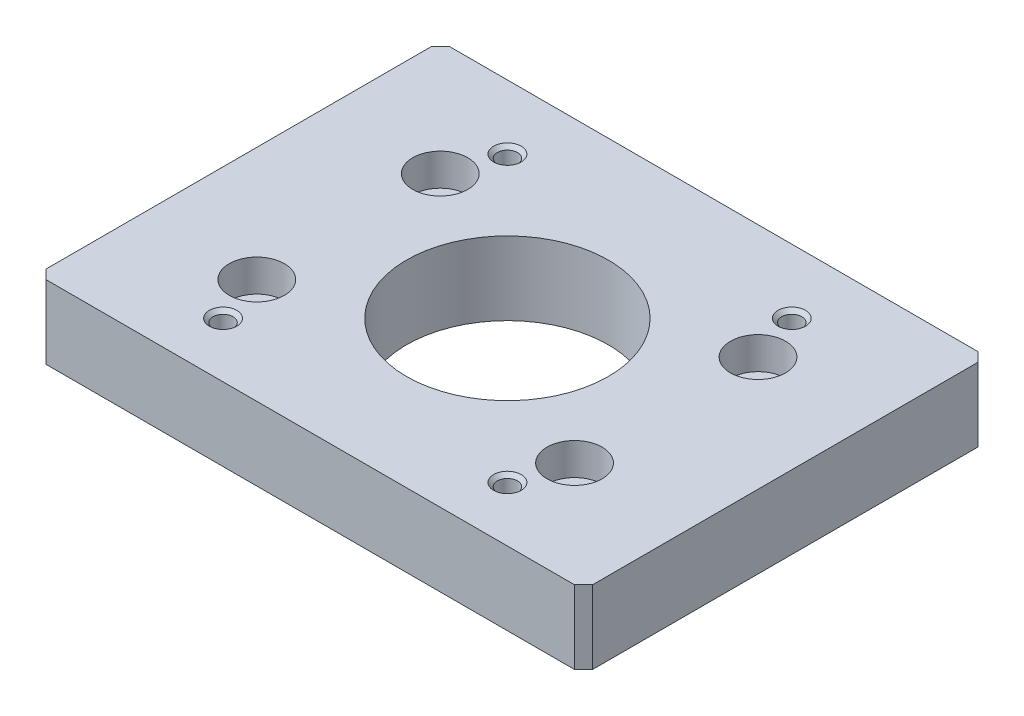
ISO-10303-21;
HEADER;
FILE_DESCRIPTION(('STEP AP214'),'2;1');
FILE_NAME('part.step','',(''),(''),'','','');
FILE_SCHEMA(('AUTOMOTIVE_DESIGN { 1 0 10303 214 1 1 1 1 }'));
ENDSEC;
DATA;
#1=APPLICATION_CONTEXT('core data for automotive mechanical design processes');
#2=APPLICATION_PROTOCOL_DEFINITION('international standard','automotive_design',2000,#1);
#3=PRODUCT_CONTEXT('',#1,'mechanical');
#4=PRODUCT('Part','Part','',(#3));
#5=PRODUCT_RELATED_PRODUCT_CATEGORY('part','',(#4));
#6=PRODUCT_DEFINITION_FORMATION('','',#4);
#7=PRODUCT_DEFINITION_CONTEXT('part definition',#1,'design');
#8=PRODUCT_DEFINITION('design','',#6,#7);
#9=PRODUCT_DEFINITION_SHAPE('','',#8);
#10=(LENGTH_UNIT() NAMED_UNIT(*) SI_UNIT(.MILLI.,.METRE.));
#11=(NAMED_UNIT(*) PLANE_ANGLE_UNIT() SI_UNIT($,.RADIAN.));
#12=(NAMED_UNIT(*) SI_UNIT($,.STERADIAN.) SOLID_ANGLE_UNIT());
#13=UNCERTAINTY_MEASURE_WITH_UNIT(LENGTH_MEASURE(1.E-05),#10,'distance_accuracy_value','');
#14=(GEOMETRIC_REPRESENTATION_CONTEXT(3) GLOBAL_UNCERTAINTY_ASSIGNED_CONTEXT((#13)) GLOBAL_UNIT_ASSIGNED_CONTEXT((#10,
#11,#12)) REPRESENTATION_CONTEXT('',''));
#15=CARTESIAN_POINT('',(0.,0.,0.));
#16=DIRECTION('',(0.,0.,1.));
#17=DIRECTION('',(1.,0.,0.));
#18=AXIS2_PLACEMENT_3D('',#15,#16,#17);
#19=CARTESIAN_POINT('',(-15.5,7.60000000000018,-15.));
#20=DIRECTION('',(0.,1.,0.));
#21=DIRECTION('',(-1.,0.,0.));
#22=AXIS2_PLACEMENT_3D('',#19,#20,#21);
#23=CONICAL_SURFACE('',#22,1.09999999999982,0.785398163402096);
#24=CARTESIAN_POINT('',(-15.5,7.6,-15.));
#25=DIRECTION('',(0.,1.,0.));
#26=DIRECTION('',(1.,0.,0.));
#27=AXIS2_PLACEMENT_3D('',#24,#25,#26);
#28=CIRCLE('',#27,1.1);
#29=CARTESIAN_POINT('',(-14.4,7.6,-15.));
#30=VERTEX_POINT('',#29);
#31=EDGE_CURVE('E191',#30,#30,#28,.F.);
#32=ORIENTED_EDGE('',*,*,#31,.T.);
#33=EDGE_LOOP('',(#32));
#34=FACE_BOUND('',#33,.T.);
#35=CARTESIAN_POINT('',(-15.5,7.99999999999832,-15.));
#36=DIRECTION('',(0.,1.,0.));
#37=DIRECTION('',(-1.,0.,0.));
#38=AXIS2_PLACEMENT_3D('',#35,#36,#37);
#39=CIRCLE('',#38,1.50000000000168);
#40=CARTESIAN_POINT('',(-17.0000000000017,7.99999999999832,-15.));
#41=VERTEX_POINT('',#40);
#42=EDGE_CURVE('E174',#41,#41,#39,.T.);
#43=ORIENTED_EDGE('',*,*,#42,.T.);
#44=EDGE_LOOP('',(#43));
#45=FACE_BOUND('',#44,.T.);
#46=ADVANCED_FACE('F16',(#34,#45),#23,.F.);
#47=CARTESIAN_POINT('',(15.5,7.60000000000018,-15.));
#48=DIRECTION('',(0.,1.,0.));
#49=DIRECTION('',(-1.,0.,0.));
#50=AXIS2_PLACEMENT_3D('',#47,#48,#49);
#51=CONICAL_SURFACE('',#50,1.09999999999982,0.785398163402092);
#52=CARTESIAN_POINT('',(15.5,7.6,-15.));
#53=DIRECTION('',(0.,1.,0.));
#54=DIRECTION('',(1.,0.,0.));
#55=AXIS2_PLACEMENT_3D('',#52,#53,#54);
#56=CIRCLE('',#55,1.1);
#57=CARTESIAN_POINT('',(16.6,7.6,-15.));
#58=VERTEX_POINT('',#57);
#59=EDGE_CURVE('E195',#58,#58,#56,.F.);
#60=ORIENTED_EDGE('',*,*,#59,.T.);
#61=EDGE_LOOP('',(#60));
#62=FACE_BOUND('',#61,.T.);
#63=CARTESIAN_POINT('',(15.5,7.99999999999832,-15.));
#64=DIRECTION('',(0.,1.,0.));
#65=DIRECTION('',(-1.,0.,0.));
#66=AXIS2_PLACEMENT_3D('',#63,#64,#65);
#67=CIRCLE('',#66,1.50000000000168);
#68=CARTESIAN_POINT('',(13.9999999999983,7.99999999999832,-15.));
#69=VERTEX_POINT('',#68);
#70=EDGE_CURVE('E171',#69,#69,#67,.T.);
#71=ORIENTED_EDGE('',*,*,#70,.T.);
#72=EDGE_LOOP('',(#71));
#73=FACE_BOUND('',#72,.T.);
#74=ADVANCED_FACE('F359',(#62,#73),#51,.F.);
#75=CARTESIAN_POINT('',(-15.5,7.60000000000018,16.));
#76=DIRECTION('',(0.,1.,0.));
#77=DIRECTION('',(0.,0.,1.));
#78=AXIS2_PLACEMENT_3D('',#75,#76,#77);
#79=CONICAL_SURFACE('',#78,1.09999999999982,0.785398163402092);
#80=CARTESIAN_POINT('',(-15.5,7.6,16.));
#81=DIRECTION('',(0.,1.,0.));
#82=DIRECTION('',(1.,0.,0.));
#83=AXIS2_PLACEMENT_3D('',#80,#81,#82);
#84=CIRCLE('',#83,1.1);
#85=CARTESIAN_POINT('',(-14.4,7.6,16.));
#86=VERTEX_POINT('',#85);
#87=EDGE_CURVE('E208',#86,#86,#84,.F.);
#88=ORIENTED_EDGE('',*,*,#87,.T.);
#89=EDGE_LOOP('',(#88));
#90=FACE_BOUND('',#89,.T.);
#91=CARTESIAN_POINT('',(-15.5,7.99999999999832,16.));
#92=DIRECTION('',(0.,1.,0.));
#93=DIRECTION('',(0.,0.,1.));
#94=AXIS2_PLACEMENT_3D('',#91,#92,#93);
#95=CIRCLE('',#94,1.50000000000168);
#96=CARTESIAN_POINT('',(-15.5,7.99999999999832,17.5000000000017));
#97=VERTEX_POINT('',#96);
#98=EDGE_CURVE('E168',#97,#97,#95,.T.);
#99=ORIENTED_EDGE('',*,*,#98,.T.);
#100=EDGE_LOOP('',(#99));
#101=FACE_BOUND('',#100,.T.);
#102=ADVANCED_FACE('F355',(#90,#101),#79,.F.);
#103=CARTESIAN_POINT('',(15.5,7.60000000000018,16.));
#104=DIRECTION('',(0.,1.,0.));
#105=DIRECTION('',(0.,0.,1.));
#106=AXIS2_PLACEMENT_3D('',#103,#104,#105);
#107=CONICAL_SURFACE('',#106,1.09999999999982,0.785398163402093);
#108=CARTESIAN_POINT('',(15.5,7.6,16.));
#109=DIRECTION('',(0.,1.,0.));
#110=DIRECTION('',(1.,0.,0.));
#111=AXIS2_PLACEMENT_3D('',#108,#109,#110);
#112=CIRCLE('',#111,1.1);
#113=CARTESIAN_POINT('',(16.6,7.6,16.));
#114=VERTEX_POINT('',#113);
#115=EDGE_CURVE('E200',#114,#114,#112,.F.);
#116=ORIENTED_EDGE('',*,*,#115,.T.);
#117=EDGE_LOOP('',(#116));
#118=FACE_BOUND('',#117,.T.);
#119=CARTESIAN_POINT('',(15.5,7.99999999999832,16.));
#120=DIRECTION('',(0.,1.,0.));
#121=DIRECTION('',(0.,0.,1.));
#122=AXIS2_PLACEMENT_3D('',#119,#120,#121);
#123=CIRCLE('',#122,1.50000000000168);
#124=CARTESIAN_POINT('',(15.5,7.99999999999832,17.5000000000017));
#125=VERTEX_POINT('',#124);
#126=EDGE_CURVE('E165',#125,#125,#123,.T.);
#127=ORIENTED_EDGE('',*,*,#126,.T.);
#128=EDGE_LOOP('',(#127));
#129=FACE_BOUND('',#128,.T.);
#130=ADVANCED_FACE('F352',(#118,#129),#107,.F.);
#131=CARTESIAN_POINT('',(17.32050807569,4.5,-9.5));
#132=DIRECTION('',(0.,1.,0.));
#133=DIRECTION('',(0.,0.,1.));
#134=AXIS2_PLACEMENT_3D('',#131,#132,#133);
#135=CYLINDRICAL_SURFACE('',#134,3.);
#136=CARTESIAN_POINT('',(17.32050807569,4.5,-9.5));
#137=DIRECTION('',(0.,1.,0.));
#138=DIRECTION('',(0.,0.,1.));
#139=AXIS2_PLACEMENT_3D('',#136,#137,#138);
#140=CIRCLE('',#139,3.);
#141=CARTESIAN_POINT('',(17.32050807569,4.5,-6.5));
#142=VERTEX_POINT('',#141);
#143=EDGE_CURVE('E20',#142,#142,#140,.F.);
#144=ORIENTED_EDGE('',*,*,#143,.T.);
#145=EDGE_LOOP('',(#144));
#146=FACE_BOUND('',#145,.T.);
#147=CARTESIAN_POINT('',(17.32050807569,8.,-9.5));
#148=DIRECTION('',(0.,1.,0.));
#149=DIRECTION('',(0.,0.,1.));
#150=AXIS2_PLACEMENT_3D('',#147,#148,#149);
#151=CIRCLE('',#150,3.);
#152=CARTESIAN_POINT('',(17.32050807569,8.,-6.5));
#153=VERTEX_POINT('',#152);
#154=EDGE_CURVE('E162',#153,#153,#151,.T.);
#155=ORIENTED_EDGE('',*,*,#154,.T.);
#156=EDGE_LOOP('',(#155));
#157=FACE_BOUND('',#156,.T.);
#158=ADVANCED_FACE('F348',(#146,#157),#135,.F.);
#159=CARTESIAN_POINT('',(-17.32050807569,4.5,-9.5));
#160=DIRECTION('',(0.,1.,0.));
#161=DIRECTION('',(0.,0.,1.));
#162=AXIS2_PLACEMENT_3D('',#159,#160,#161);
#163=CYLINDRICAL_SURFACE('',#162,3.);
#164=CARTESIAN_POINT('',(-17.32050807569,4.5,-9.5));
#165=DIRECTION('',(0.,1.,0.));
#166=DIRECTION('',(0.,0.,1.));
#167=AXIS2_PLACEMENT_3D('',#164,#165,#166);
#168=CIRCLE('',#167,3.);
#169=CARTESIAN_POINT('',(-17.32050807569,4.5,-6.5));
#170=VERTEX_POINT('',#169);
#171=EDGE_CURVE('E184',#170,#170,#168,.F.);
#172=ORIENTED_EDGE('',*,*,#171,.T.);
#173=EDGE_LOOP('',(#172));
#174=FACE_BOUND('',#173,.T.);
#175=CARTESIAN_POINT('',(-17.32050807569,8.,-9.5));
#176=DIRECTION('',(0.,1.,0.));
#177=DIRECTION('',(0.,0.,1.));
#178=AXIS2_PLACEMENT_3D('',#175,#176,#177);
#179=CIRCLE('',#178,3.);
#180=CARTESIAN_POINT('',(-17.32050807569,8.,-6.5));
#181=VERTEX_POINT('',#180);
#182=EDGE_CURVE('E159',#181,#181,#179,.T.);
#183=ORIENTED_EDGE('',*,*,#182,.T.);
#184=EDGE_LOOP('',(#183));
#185=FACE_BOUND('',#184,.T.);
#186=ADVANCED_FACE('F344',(#174,#185),#163,.F.);
#187=CARTESIAN_POINT('',(-17.32050807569,4.5,10.5));
#188=DIRECTION('',(0.,1.,0.));
#189=DIRECTION('',(0.,0.,1.));
#190=AXIS2_PLACEMENT_3D('',#187,#188,#189);
#191=CYLINDRICAL_SURFACE('',#190,3.);
#192=CARTESIAN_POINT('',(-17.32050807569,4.5,10.5));
#193=DIRECTION('',(0.,1.,0.));
#194=DIRECTION('',(0.,0.,1.));
#195=AXIS2_PLACEMENT_3D('',#192,#193,#194);
#196=CIRCLE('',#195,3.);
#197=CARTESIAN_POINT('',(-17.32050807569,4.5,13.5));
#198=VERTEX_POINT('',#197);
#199=EDGE_CURVE('E90',#198,#198,#196,.F.);
#200=ORIENTED_EDGE('',*,*,#199,.T.);
#201=EDGE_LOOP('',(#200));
#202=FACE_BOUND('',#201,.T.);
#203=CARTESIAN_POINT('',(-17.32050807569,8.,10.5));
#204=DIRECTION('',(0.,1.,0.));
#205=DIRECTION('',(0.,0.,1.));
#206=AXIS2_PLACEMENT_3D('',#203,#204,#205);
#207=CIRCLE('',#206,3.);
#208=CARTESIAN_POINT('',(-17.32050807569,8.,13.5));
#209=VERTEX_POINT('',#208);
#210=EDGE_CURVE('E107',#209,#209,#207,.T.);
#211=ORIENTED_EDGE('',*,*,#210,.T.);
#212=EDGE_LOOP('',(#211));
#213=FACE_BOUND('',#212,.T.);
#214=ADVANCED_FACE('F341',(#202,#213),#191,.F.);
#215=CARTESIAN_POINT('',(17.32050807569,4.5,10.5));
#216=DIRECTION('',(0.,1.,0.));
#217=DIRECTION('',(0.,0.,1.));
#218=AXIS2_PLACEMENT_3D('',#215,#216,#217);
#219=CYLINDRICAL_SURFACE('',#218,3.);
#220=CARTESIAN_POINT('',(17.32050807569,4.5,10.5));
#221=DIRECTION('',(0.,1.,0.));
#222=DIRECTION('',(0.,0.,1.));
#223=AXIS2_PLACEMENT_3D('',#220,#221,#222);
#224=CIRCLE('',#223,3.);
#225=CARTESIAN_POINT('',(17.32050807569,4.5,13.5));
#226=VERTEX_POINT('',#225);
#227=EDGE_CURVE('E186',#226,#226,#224,.F.);
#228=ORIENTED_EDGE('',*,*,#227,.T.);
#229=EDGE_LOOP('',(#228));
#230=FACE_BOUND('',#229,.T.);
#231=CARTESIAN_POINT('',(17.32050807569,8.,10.5));
#232=DIRECTION('',(0.,1.,0.));
#233=DIRECTION('',(0.,0.,1.));
#234=AXIS2_PLACEMENT_3D('',#231,#232,#233);
#235=CIRCLE('',#234,3.);
#236=CARTESIAN_POINT('',(17.32050807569,8.,13.5));
#237=VERTEX_POINT('',#236);
#238=EDGE_CURVE('E104',#237,#237,#235,.T.);
#239=ORIENTED_EDGE('',*,*,#238,.T.);
#240=EDGE_LOOP('',(#239));
#241=FACE_BOUND('',#240,.T.);
#242=ADVANCED_FACE('F338',(#230,#241),#219,.F.);
#243=CARTESIAN_POINT('',(-29.86914683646,8.16,-20.93085316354));
#244=DIRECTION('',(-0.707106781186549,0.,-0.707106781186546));
#245=DIRECTION('',(0.707106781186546,0.,-0.707106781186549));
#246=AXIS2_PLACEMENT_3D('',#243,#244,#245);
#247=PLANE('',#246);
#248=DIRECTION('',(0.707106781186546,0.,-0.707106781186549));
#249=VECTOR('',#248,1.);
#250=CARTESIAN_POINT('',(-29.86914683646,8.,-20.93085316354));
#251=LINE('',#250,#249);
#252=CARTESIAN_POINT('',(-29.8,8.,-21.));
#253=VERTEX_POINT('',#252);
#254=CARTESIAN_POINT('',(-28.8,8.,-22.));
#255=VERTEX_POINT('',#254);
#256=EDGE_CURVE('E177',#253,#255,#251,.T.);
#257=ORIENTED_EDGE('',*,*,#256,.T.);
#258=DIRECTION('',(0.,1.,0.));
#259=VECTOR('',#258,1.);
#260=CARTESIAN_POINT('',(-28.8,4.,-22.));
#261=LINE('',#260,#259);
#262=CARTESIAN_POINT('',(-28.8,0.,-22.));
#263=VERTEX_POINT('',#262);
#264=EDGE_CURVE('E100',#255,#263,#261,.F.);
#265=ORIENTED_EDGE('',*,*,#264,.T.);
#266=DIRECTION('',(-0.707106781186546,0.,0.707106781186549));
#267=VECTOR('',#266,1.);
#268=CARTESIAN_POINT('',(-29.3,0.,-21.5));
#269=LINE('',#268,#267);
#270=CARTESIAN_POINT('',(-29.8,0.,-21.));
#271=VERTEX_POINT('',#270);
#272=EDGE_CURVE('E203',#271,#263,#269,.F.);
#273=ORIENTED_EDGE('',*,*,#272,.F.);
#274=DIRECTION('',(0.,-1.,0.));
#275=VECTOR('',#274,1.);
#276=CARTESIAN_POINT('',(-29.8,4.,-21.));
#277=LINE('',#276,#275);
#278=EDGE_CURVE('E215',#271,#253,#277,.F.);
#279=ORIENTED_EDGE('',*,*,#278,.T.);
#280=EDGE_LOOP('',(#257,#265,#273,#279));
#281=FACE_BOUND('',#280,.T.);
#282=ADVANCED_FACE('F261',(#281),#247,.T.);
#283=CARTESIAN_POINT('',(-28.73085316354,8.16,22.06914683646));
#284=DIRECTION('',(-0.707106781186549,0.,0.707106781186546));
#285=DIRECTION('',(-0.707106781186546,0.,-0.707106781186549));
#286=AXIS2_PLACEMENT_3D('',#283,#284,#285);
#287=PLANE('',#286);
#288=DIRECTION('',(-0.707106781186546,0.,-0.707106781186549));
#289=VECTOR('',#288,1.);
#290=CARTESIAN_POINT('',(-28.73085316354,8.,22.06914683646));
#291=LINE('',#290,#289);
#292=CARTESIAN_POINT('',(-28.8,8.,22.));
#293=VERTEX_POINT('',#292);
#294=CARTESIAN_POINT('',(-29.8,8.,21.));
#295=VERTEX_POINT('',#294);
#296=EDGE_CURVE('E179',#293,#295,#291,.T.);
#297=ORIENTED_EDGE('',*,*,#296,.T.);
#298=DIRECTION('',(0.,1.,0.));
#299=VECTOR('',#298,1.);
#300=CARTESIAN_POINT('',(-29.8,4.,21.));
#301=LINE('',#300,#299);
#302=CARTESIAN_POINT('',(-29.8,0.,21.));
#303=VERTEX_POINT('',#302);
#304=EDGE_CURVE('E214',#295,#303,#301,.F.);
#305=ORIENTED_EDGE('',*,*,#304,.T.);
#306=DIRECTION('',(0.707106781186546,0.,0.707106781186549));
#307=VECTOR('',#306,1.);
#308=CARTESIAN_POINT('',(-29.3,0.,21.5));
#309=LINE('',#308,#307);
#310=CARTESIAN_POINT('',(-28.8,0.,22.));
#311=VERTEX_POINT('',#310);
#312=EDGE_CURVE('E257',#311,#303,#309,.F.);
#313=ORIENTED_EDGE('',*,*,#312,.F.);
#314=DIRECTION('',(0.,-1.,0.));
#315=VECTOR('',#314,1.);
#316=CARTESIAN_POINT('',(-28.8,4.,22.));
#317=LINE('',#316,#315);
#318=EDGE_CURVE('E222',#311,#293,#317,.F.);
#319=ORIENTED_EDGE('',*,*,#318,.T.);
#320=EDGE_LOOP('',(#297,#305,#313,#319));
#321=FACE_BOUND('',#320,.T.);
#322=ADVANCED_FACE('F267',(#321),#287,.T.);
#323=CARTESIAN_POINT('',(28.73085316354,8.16,-22.06914683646));
#324=DIRECTION('',(0.707106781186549,0.,-0.707106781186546));
#325=DIRECTION('',(0.707106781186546,0.,0.707106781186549));
#326=AXIS2_PLACEMENT_3D('',#323,#324,#325);
#327=PLANE('',#326);
#328=DIRECTION('',(0.707106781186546,0.,0.707106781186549));
#329=VECTOR('',#328,1.);
#330=CARTESIAN_POINT('',(28.73085316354,8.,-22.06914683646));
#331=LINE('',#330,#329);
#332=CARTESIAN_POINT('',(28.8,8.,-22.));
#333=VERTEX_POINT('',#332);
#334=CARTESIAN_POINT('',(29.8,8.,-21.));
#335=VERTEX_POINT('',#334);
#336=EDGE_CURVE('E80',#333,#335,#331,.T.);
#337=ORIENTED_EDGE('',*,*,#336,.T.);
#338=DIRECTION('',(0.,1.,0.));
#339=VECTOR('',#338,1.);
#340=CARTESIAN_POINT('',(29.8,4.,-21.));
#341=LINE('',#340,#339);
#342=CARTESIAN_POINT('',(29.8,0.,-21.));
#343=VERTEX_POINT('',#342);
#344=EDGE_CURVE('E113',#335,#343,#341,.F.);
#345=ORIENTED_EDGE('',*,*,#344,.T.);
#346=DIRECTION('',(-0.707106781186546,0.,-0.707106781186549));
#347=VECTOR('',#346,1.);
#348=CARTESIAN_POINT('',(29.3,0.,-21.5));
#349=LINE('',#348,#347);
#350=CARTESIAN_POINT('',(28.8,0.,-22.));
#351=VERTEX_POINT('',#350);
#352=EDGE_CURVE('E103',#351,#343,#349,.F.);
#353=ORIENTED_EDGE('',*,*,#352,.F.);
#354=DIRECTION('',(0.,-1.,0.));
#355=VECTOR('',#354,1.);
#356=CARTESIAN_POINT('',(28.8,4.,-22.));
#357=LINE('',#356,#355);
#358=EDGE_CURVE('E97',#351,#333,#357,.F.);
#359=ORIENTED_EDGE('',*,*,#358,.T.);
#360=EDGE_LOOP('',(#337,#345,#353,#359));
#361=FACE_BOUND('',#360,.T.);
#362=ADVANCED_FACE('F102',(#361),#327,.T.);
#363=CARTESIAN_POINT('',(29.86914683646,8.16,20.93085316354));
#364=DIRECTION('',(0.707106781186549,0.,0.707106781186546));
#365=DIRECTION('',(-0.707106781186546,0.,0.707106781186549));
#366=AXIS2_PLACEMENT_3D('',#363,#364,#365);
#367=PLANE('',#366);
#368=DIRECTION('',(-0.707106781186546,0.,0.707106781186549));
#369=VECTOR('',#368,1.);
#370=CARTESIAN_POINT('',(29.86914683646,8.,20.93085316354));
#371=LINE('',#370,#369);
#372=CARTESIAN_POINT('',(29.8,8.,21.));
#373=VERTEX_POINT('',#372);
#374=CARTESIAN_POINT('',(28.8,8.,22.));
#375=VERTEX_POINT('',#374);
#376=EDGE_CURVE('E89',#373,#375,#371,.T.);
#377=ORIENTED_EDGE('',*,*,#376,.T.);
#378=DIRECTION('',(0.,1.,0.));
#379=VECTOR('',#378,1.);
#380=CARTESIAN_POINT('',(28.8,4.,22.));
#381=LINE('',#380,#379);
#382=CARTESIAN_POINT('',(28.8,0.,22.));
#383=VERTEX_POINT('',#382);
#384=EDGE_CURVE('E111',#375,#383,#381,.F.);
#385=ORIENTED_EDGE('',*,*,#384,.T.);
#386=DIRECTION('',(0.707106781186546,0.,-0.707106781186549));
#387=VECTOR('',#386,1.);
#388=CARTESIAN_POINT('',(29.3,0.,21.5));
#389=LINE('',#388,#387);
#390=CARTESIAN_POINT('',(29.8,0.,21.));
#391=VERTEX_POINT('',#390);
#392=EDGE_CURVE('E35',#391,#383,#389,.F.);
#393=ORIENTED_EDGE('',*,*,#392,.F.);
#394=DIRECTION('',(0.,-1.,0.));
#395=VECTOR('',#394,1.);
#396=CARTESIAN_POINT('',(29.8,4.,21.));
#397=LINE('',#396,#395);
#398=EDGE_CURVE('E114',#391,#373,#397,.F.);
#399=ORIENTED_EDGE('',*,*,#398,.T.);
#400=EDGE_LOOP('',(#377,#385,#393,#399));
#401=FACE_BOUND('',#400,.T.);
#402=ADVANCED_FACE('F228',(#401),#367,.T.);
#403=CARTESIAN_POINT('',(-15.5,0.4,16.));
#404=DIRECTION('',(0.,1.,0.));
#405=DIRECTION('',(0.,0.,1.));
#406=AXIS2_PLACEMENT_3D('',#403,#404,#405);
#407=CYLINDRICAL_SURFACE('',#406,1.1);
#408=CARTESIAN_POINT('',(-15.5,0.399999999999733,16.));
#409=DIRECTION('',(0.,-1.,0.));
#410=DIRECTION('',(0.,0.,-1.));
#411=AXIS2_PLACEMENT_3D('',#408,#409,#410);
#412=CIRCLE('',#411,1.09999999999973);
#413=CARTESIAN_POINT('',(-15.5,0.399999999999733,14.9000000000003));
#414=VERTEX_POINT('',#413);
#415=EDGE_CURVE('E227',#414,#414,#412,.T.);
#416=ORIENTED_EDGE('',*,*,#415,.T.);
#417=EDGE_LOOP('',(#416));
#418=FACE_BOUND('',#417,.T.);
#419=ORIENTED_EDGE('',*,*,#87,.F.);
#420=EDGE_LOOP('',(#419));
#421=FACE_BOUND('',#420,.T.);
#422=ADVANCED_FACE('F333',(#418,#421),#407,.F.);
#423=CARTESIAN_POINT('',(15.5,0.4,16.));
#424=DIRECTION('',(0.,1.,0.));
#425=DIRECTION('',(0.,0.,1.));
#426=AXIS2_PLACEMENT_3D('',#423,#424,#425);
#427=CYLINDRICAL_SURFACE('',#426,1.1);
#428=CARTESIAN_POINT('',(15.5,0.399999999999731,16.));
#429=DIRECTION('',(0.,-1.,0.));
#430=DIRECTION('',(0.,0.,-1.));
#431=AXIS2_PLACEMENT_3D('',#428,#429,#430);
#432=CIRCLE('',#431,1.09999999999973);
#433=CARTESIAN_POINT('',(15.5,0.399999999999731,14.9000000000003));
#434=VERTEX_POINT('',#433);
#435=EDGE_CURVE('E251',#434,#434,#432,.T.);
#436=ORIENTED_EDGE('',*,*,#435,.T.);
#437=EDGE_LOOP('',(#436));
#438=FACE_BOUND('',#437,.T.);
#439=ORIENTED_EDGE('',*,*,#115,.F.);
#440=EDGE_LOOP('',(#439));
#441=FACE_BOUND('',#440,.T.);
#442=ADVANCED_FACE('F329',(#438,#441),#427,.F.);
#443=CARTESIAN_POINT('',(15.5,0.4,-15.));
#444=DIRECTION('',(0.,1.,0.));
#445=DIRECTION('',(0.,0.,1.));
#446=AXIS2_PLACEMENT_3D('',#443,#444,#445);
#447=CYLINDRICAL_SURFACE('',#446,1.1);
#448=CARTESIAN_POINT('',(15.5,0.399999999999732,-15.));
#449=DIRECTION('',(0.,-1.,0.));
#450=DIRECTION('',(0.,0.,-1.));
#451=AXIS2_PLACEMENT_3D('',#448,#449,#450);
#452=CIRCLE('',#451,1.09999999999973);
#453=CARTESIAN_POINT('',(15.5,0.399999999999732,-16.0999999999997));
#454=VERTEX_POINT('',#453);
#455=EDGE_CURVE('E248',#454,#454,#452,.T.);
#456=ORIENTED_EDGE('',*,*,#455,.T.);
#457=EDGE_LOOP('',(#456));
#458=FACE_BOUND('',#457,.T.);
#459=ORIENTED_EDGE('',*,*,#59,.F.);
#460=EDGE_LOOP('',(#459));
#461=FACE_BOUND('',#460,.T.);
#462=ADVANCED_FACE('F325',(#458,#461),#447,.F.);
#463=CARTESIAN_POINT('',(-15.5,0.4,-15.));
#464=DIRECTION('',(0.,1.,0.));
#465=DIRECTION('',(0.,0.,1.));
#466=AXIS2_PLACEMENT_3D('',#463,#464,#465);
#467=CYLINDRICAL_SURFACE('',#466,1.1);
#468=CARTESIAN_POINT('',(-15.5,0.399999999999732,-15.));
#469=DIRECTION('',(0.,-1.,0.));
#470=DIRECTION('',(0.,0.,-1.));
#471=AXIS2_PLACEMENT_3D('',#468,#469,#470);
#472=CIRCLE('',#471,1.09999999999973);
#473=CARTESIAN_POINT('',(-15.5,0.399999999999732,-16.0999999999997));
#474=VERTEX_POINT('',#473);
#475=EDGE_CURVE('E155',#474,#474,#472,.T.);
#476=ORIENTED_EDGE('',*,*,#475,.T.);
#477=EDGE_LOOP('',(#476));
#478=FACE_BOUND('',#477,.T.);
#479=ORIENTED_EDGE('',*,*,#31,.F.);
#480=EDGE_LOOP('',(#479));
#481=FACE_BOUND('',#480,.T.);
#482=ADVANCED_FACE('F321',(#478,#481),#467,.F.);
#483=CARTESIAN_POINT('',(-21.13332839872,4.5,14.02650185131));
#484=DIRECTION('',(0.,1.,0.));
#485=DIRECTION('',(1.,0.,0.));
#486=AXIS2_PLACEMENT_3D('',#483,#484,#485);
#487=PLANE('',#486);
#488=CARTESIAN_POINT('',(17.32050807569,4.5,-9.5));
#489=DIRECTION('',(0.,1.,0.));
#490=DIRECTION('',(0.,0.,1.));
#491=AXIS2_PLACEMENT_3D('',#488,#489,#490);
#492=CIRCLE('',#491,1.74999999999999);
#493=CARTESIAN_POINT('',(17.32050807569,4.5,-7.75000000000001));
#494=VERTEX_POINT('',#493);
#495=EDGE_CURVE('E153',#494,#494,#492,.F.);
#496=ORIENTED_EDGE('',*,*,#495,.T.);
#497=EDGE_LOOP('',(#496));
#498=FACE_BOUND('',#497,.T.);
#499=ORIENTED_EDGE('',*,*,#143,.F.);
#500=EDGE_LOOP('',(#499));
#501=FACE_BOUND('',#500,.T.);
#502=ADVANCED_FACE('F324',(#498,#501),#487,.T.);
#503=CARTESIAN_POINT('',(-21.13332839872,4.5,14.02650185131));
#504=DIRECTION('',(0.,1.,0.));
#505=DIRECTION('',(1.,0.,0.));
#506=AXIS2_PLACEMENT_3D('',#503,#504,#505);
#507=PLANE('',#506);
#508=CARTESIAN_POINT('',(17.32050807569,4.5,10.5));
#509=DIRECTION('',(0.,1.,0.));
#510=DIRECTION('',(0.,0.,1.));
#511=AXIS2_PLACEMENT_3D('',#508,#509,#510);
#512=CIRCLE('',#511,1.74999999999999);
#513=CARTESIAN_POINT('',(17.32050807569,4.5,12.25));
#514=VERTEX_POINT('',#513);
#515=EDGE_CURVE('E150',#514,#514,#512,.F.);
#516=ORIENTED_EDGE('',*,*,#515,.T.);
#517=EDGE_LOOP('',(#516));
#518=FACE_BOUND('',#517,.T.);
#519=ORIENTED_EDGE('',*,*,#227,.F.);
#520=EDGE_LOOP('',(#519));
#521=FACE_BOUND('',#520,.T.);
#522=ADVANCED_FACE('F376',(#518,#521),#507,.T.);
#523=CARTESIAN_POINT('',(-21.13332839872,4.5,14.02650185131));
#524=DIRECTION('',(0.,1.,0.));
#525=DIRECTION('',(1.,0.,0.));
#526=AXIS2_PLACEMENT_3D('',#523,#524,#525);
#527=PLANE('',#526);
#528=CARTESIAN_POINT('',(-17.32050807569,4.5,-9.5));
#529=DIRECTION('',(0.,1.,0.));
#530=DIRECTION('',(0.,0.,1.));
#531=AXIS2_PLACEMENT_3D('',#528,#529,#530);
#532=CIRCLE('',#531,1.75);
#533=CARTESIAN_POINT('',(-17.32050807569,4.5,-7.75));
#534=VERTEX_POINT('',#533);
#535=EDGE_CURVE('E147',#534,#534,#532,.F.);
#536=ORIENTED_EDGE('',*,*,#535,.T.);
#537=EDGE_LOOP('',(#536));
#538=FACE_BOUND('',#537,.T.);
#539=ORIENTED_EDGE('',*,*,#171,.F.);
#540=EDGE_LOOP('',(#539));
#541=FACE_BOUND('',#540,.T.);
#542=ADVANCED_FACE('F380',(#538,#541),#527,.T.);
#543=CARTESIAN_POINT('',(-21.13332839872,4.5,14.02650185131));
#544=DIRECTION('',(0.,1.,0.));
#545=DIRECTION('',(1.,0.,0.));
#546=AXIS2_PLACEMENT_3D('',#543,#544,#545);
#547=PLANE('',#546);
#548=CARTESIAN_POINT('',(-17.32050807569,4.5,10.5));
#549=DIRECTION('',(0.,1.,0.));
#550=DIRECTION('',(0.,0.,1.));
#551=AXIS2_PLACEMENT_3D('',#548,#549,#550);
#552=CIRCLE('',#551,1.75);
#553=CARTESIAN_POINT('',(-17.32050807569,4.5,12.25));
#554=VERTEX_POINT('',#553);
#555=EDGE_CURVE('E144',#554,#554,#552,.F.);
#556=ORIENTED_EDGE('',*,*,#555,.T.);
#557=EDGE_LOOP('',(#556));
#558=FACE_BOUND('',#557,.T.);
#559=ORIENTED_EDGE('',*,*,#199,.F.);
#560=EDGE_LOOP('',(#559));
#561=FACE_BOUND('',#560,.T.);
#562=ADVANCED_FACE('F384',(#558,#561),#547,.T.);
#563=CARTESIAN_POINT('',(-30.992,8.,22.88));
#564=DIRECTION('',(0.,1.,0.));
#565=DIRECTION('',(1.,0.,0.));
#566=AXIS2_PLACEMENT_3D('',#563,#564,#565);
#567=PLANE('',#566);
#568=CARTESIAN_POINT('',(0.,8.,0.5));
#569=DIRECTION('',(0.,1.,0.));
#570=DIRECTION('',(0.,0.,1.));
#571=AXIS2_PLACEMENT_3D('',#568,#569,#570);
#572=CIRCLE('',#571,11.);
#573=CARTESIAN_POINT('',(0.,8.,11.5));
#574=VERTEX_POINT('',#573);
#575=EDGE_CURVE('E140',#574,#574,#572,.F.);
#576=ORIENTED_EDGE('',*,*,#575,.T.);
#577=EDGE_LOOP('',(#576));
#578=FACE_BOUND('',#577,.T.);
#579=ORIENTED_EDGE('',*,*,#238,.F.);
#580=EDGE_LOOP('',(#579));
#581=FACE_BOUND('',#580,.T.);
#582=ORIENTED_EDGE('',*,*,#210,.F.);
#583=EDGE_LOOP('',(#582));
#584=FACE_BOUND('',#583,.T.);
#585=ORIENTED_EDGE('',*,*,#182,.F.);
#586=EDGE_LOOP('',(#585));
#587=FACE_BOUND('',#586,.T.);
#588=ORIENTED_EDGE('',*,*,#154,.F.);
#589=EDGE_LOOP('',(#588));
#590=FACE_BOUND('',#589,.T.);
#591=ORIENTED_EDGE('',*,*,#126,.F.);
#592=EDGE_LOOP('',(#591));
#593=FACE_BOUND('',#592,.T.);
#594=ORIENTED_EDGE('',*,*,#98,.F.);
#595=EDGE_LOOP('',(#594));
#596=FACE_BOUND('',#595,.T.);
#597=ORIENTED_EDGE('',*,*,#70,.F.);
#598=EDGE_LOOP('',(#597));
#599=FACE_BOUND('',#598,.T.);
#600=ORIENTED_EDGE('',*,*,#42,.F.);
#601=EDGE_LOOP('',(#600));
#602=FACE_BOUND('',#601,.T.);
#603=ORIENTED_EDGE('',*,*,#256,.F.);
#604=DIRECTION('',(0.,0.,-1.));
#605=VECTOR('',#604,1.);
#606=CARTESIAN_POINT('',(-29.8,8.,0.));
#607=LINE('',#606,#605);
#608=EDGE_CURVE('E211',#253,#295,#607,.F.);
#609=ORIENTED_EDGE('',*,*,#608,.T.);
#610=ORIENTED_EDGE('',*,*,#296,.F.);
#611=DIRECTION('',(-1.,0.,0.));
#612=VECTOR('',#611,1.);
#613=CARTESIAN_POINT('',(0.,8.,22.));
#614=LINE('',#613,#612);
#615=EDGE_CURVE('E219',#293,#375,#614,.F.);
#616=ORIENTED_EDGE('',*,*,#615,.T.);
#617=ORIENTED_EDGE('',*,*,#376,.F.);
#618=DIRECTION('',(0.,0.,1.));
#619=VECTOR('',#618,1.);
#620=CARTESIAN_POINT('',(29.8,8.,0.));
#621=LINE('',#620,#619);
#622=EDGE_CURVE('E85',#373,#335,#621,.F.);
#623=ORIENTED_EDGE('',*,*,#622,.T.);
#624=ORIENTED_EDGE('',*,*,#336,.F.);
#625=DIRECTION('',(1.,0.,0.));
#626=VECTOR('',#625,1.);
#627=CARTESIAN_POINT('',(0.,8.,-22.));
#628=LINE('',#627,#626);
#629=EDGE_CURVE('E83',#333,#255,#628,.F.);
#630=ORIENTED_EDGE('',*,*,#629,.T.);
#631=EDGE_LOOP('',(#603,#609,#610,#616,#617,#623,#624,#630));
#632=FACE_BOUND('',#631,.T.);
#633=ADVANCED_FACE('F82',(#578,#581,#584,#587,#590,#593,#596,#599,#602,#632),#567,.T.);
#634=CARTESIAN_POINT('',(29.952,-0.16,-22.));
#635=DIRECTION('',(0.,0.,-1.));
#636=DIRECTION('',(-1.,0.,0.));
#637=AXIS2_PLACEMENT_3D('',#634,#635,#636);
#638=PLANE('',#637);
#639=ORIENTED_EDGE('',*,*,#264,.F.);
#640=ORIENTED_EDGE('',*,*,#629,.F.);
#641=ORIENTED_EDGE('',*,*,#358,.F.);
#642=DIRECTION('',(-1.,0.,0.));
#643=VECTOR('',#642,1.);
#644=CARTESIAN_POINT('',(0.,0.,-22.));
#645=LINE('',#644,#643);
#646=EDGE_CURVE('E143',#351,#263,#645,.T.);
#647=ORIENTED_EDGE('',*,*,#646,.T.);
#648=EDGE_LOOP('',(#639,#640,#641,#647));
#649=FACE_BOUND('',#648,.T.);
#650=ADVANCED_FACE('F95',(#649),#638,.T.);
#651=CARTESIAN_POINT('',(-29.8,-0.16,-21.84));
#652=DIRECTION('',(-1.,0.,0.));
#653=DIRECTION('',(0.,0.,1.));
#654=AXIS2_PLACEMENT_3D('',#651,#652,#653);
#655=PLANE('',#654);
#656=ORIENTED_EDGE('',*,*,#304,.F.);
#657=ORIENTED_EDGE('',*,*,#608,.F.);
#658=ORIENTED_EDGE('',*,*,#278,.F.);
#659=DIRECTION('',(0.,0.,1.));
#660=VECTOR('',#659,1.);
#661=CARTESIAN_POINT('',(-29.8,0.,0.));
#662=LINE('',#661,#660);
#663=EDGE_CURVE('E240',#271,#303,#662,.T.);
#664=ORIENTED_EDGE('',*,*,#663,.T.);
#665=EDGE_LOOP('',(#656,#657,#658,#664));
#666=FACE_BOUND('',#665,.T.);
#667=ADVANCED_FACE('F265',(#666),#655,.T.);
#668=CARTESIAN_POINT('',(-29.952,-0.16,22.));
#669=DIRECTION('',(0.,0.,1.));
#670=DIRECTION('',(1.,0.,0.));
#671=AXIS2_PLACEMENT_3D('',#668,#669,#670);
#672=PLANE('',#671);
#673=ORIENTED_EDGE('',*,*,#384,.F.);
#674=ORIENTED_EDGE('',*,*,#615,.F.);
#675=ORIENTED_EDGE('',*,*,#318,.F.);
#676=DIRECTION('',(1.,0.,0.));
#677=VECTOR('',#676,1.);
#678=CARTESIAN_POINT('',(0.,0.,22.));
#679=LINE('',#678,#677);
#680=EDGE_CURVE('E237',#311,#383,#679,.T.);
#681=ORIENTED_EDGE('',*,*,#680,.T.);
#682=EDGE_LOOP('',(#673,#674,#675,#681));
#683=FACE_BOUND('',#682,.T.);
#684=ADVANCED_FACE('F271',(#683),#672,.T.);
#685=CARTESIAN_POINT('',(29.8,-0.16,21.84));
#686=DIRECTION('',(1.,0.,0.));
#687=DIRECTION('',(0.,0.,-1.));
#688=AXIS2_PLACEMENT_3D('',#685,#686,#687);
#689=PLANE('',#688);
#690=ORIENTED_EDGE('',*,*,#398,.F.);
#691=DIRECTION('',(0.,0.,-1.));
#692=VECTOR('',#691,1.);
#693=CARTESIAN_POINT('',(29.8,0.,0.));
#694=LINE('',#693,#692);
#695=EDGE_CURVE('E139',#391,#343,#694,.T.);
#696=ORIENTED_EDGE('',*,*,#695,.T.);
#697=ORIENTED_EDGE('',*,*,#344,.F.);
#698=ORIENTED_EDGE('',*,*,#622,.F.);
#699=EDGE_LOOP('',(#690,#696,#697,#698));
#700=FACE_BOUND('',#699,.T.);
#701=ADVANCED_FACE('F233',(#700),#689,.T.);
#702=CARTESIAN_POINT('',(-15.5,0.399999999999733,16.));
#703=DIRECTION('',(0.,-1.,0.));
#704=DIRECTION('',(0.,0.,-1.));
#705=AXIS2_PLACEMENT_3D('',#702,#703,#704);
#706=CONICAL_SURFACE('',#705,1.09999999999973,0.785398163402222);
#707=ORIENTED_EDGE('',*,*,#415,.F.);
#708=EDGE_LOOP('',(#707));
#709=FACE_BOUND('',#708,.T.);
#710=CARTESIAN_POINT('',(-15.5,1.64012683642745E-12,16.));
#711=DIRECTION('',(0.,-1.,0.));
#712=DIRECTION('',(0.,0.,-1.));
#713=AXIS2_PLACEMENT_3D('',#710,#711,#712);
#714=CIRCLE('',#713,1.50000000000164);
#715=CARTESIAN_POINT('',(-15.5,1.64012683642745E-12,14.4999999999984));
#716=VERTEX_POINT('',#715);
#717=EDGE_CURVE('E136',#716,#716,#714,.T.);
#718=ORIENTED_EDGE('',*,*,#717,.T.);
#719=EDGE_LOOP('',(#718));
#720=FACE_BOUND('',#719,.T.);
#721=ADVANCED_FACE('F279',(#709,#720),#706,.F.);
#722=CARTESIAN_POINT('',(15.5,0.399999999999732,16.));
#723=DIRECTION('',(0.,-1.,0.));
#724=DIRECTION('',(0.,0.,-1.));
#725=AXIS2_PLACEMENT_3D('',#722,#723,#724);
#726=CONICAL_SURFACE('',#725,1.09999999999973,0.785398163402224);
#727=ORIENTED_EDGE('',*,*,#435,.F.);
#728=EDGE_LOOP('',(#727));
#729=FACE_BOUND('',#728,.T.);
#730=CARTESIAN_POINT('',(15.5,1.64137366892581E-12,16.));
#731=DIRECTION('',(0.,-1.,0.));
#732=DIRECTION('',(0.,0.,-1.));
#733=AXIS2_PLACEMENT_3D('',#730,#731,#732);
#734=CIRCLE('',#733,1.50000000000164);
#735=CARTESIAN_POINT('',(15.5,1.64137366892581E-12,14.4999999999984));
#736=VERTEX_POINT('',#735);
#737=EDGE_CURVE('E133',#736,#736,#734,.T.);
#738=ORIENTED_EDGE('',*,*,#737,.T.);
#739=EDGE_LOOP('',(#738));
#740=FACE_BOUND('',#739,.T.);
#741=ADVANCED_FACE('F309',(#729,#740),#726,.F.);
#742=CARTESIAN_POINT('',(15.5,0.399999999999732,-15.));
#743=DIRECTION('',(0.,-1.,0.));
#744=DIRECTION('',(1.,0.,0.));
#745=AXIS2_PLACEMENT_3D('',#742,#743,#744);
#746=CONICAL_SURFACE('',#745,1.09999999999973,0.785398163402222);
#747=ORIENTED_EDGE('',*,*,#455,.F.);
#748=EDGE_LOOP('',(#747));
#749=FACE_BOUND('',#748,.T.);
#750=CARTESIAN_POINT('',(15.5,1.63915105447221E-12,-15.));
#751=DIRECTION('',(0.,-1.,0.));
#752=DIRECTION('',(1.,0.,0.));
#753=AXIS2_PLACEMENT_3D('',#750,#751,#752);
#754=CIRCLE('',#753,1.50000000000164);
#755=CARTESIAN_POINT('',(17.0000000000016,1.63911409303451E-12,-15.));
#756=VERTEX_POINT('',#755);
#757=EDGE_CURVE('E130',#756,#756,#754,.T.);
#758=ORIENTED_EDGE('',*,*,#757,.T.);
#759=EDGE_LOOP('',(#758));
#760=FACE_BOUND('',#759,.T.);
#761=ADVANCED_FACE('F315',(#749,#760),#746,.F.);
#762=CARTESIAN_POINT('',(-15.5,0.399999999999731,-15.));
#763=DIRECTION('',(0.,-1.,0.));
#764=DIRECTION('',(1.,0.,0.));
#765=AXIS2_PLACEMENT_3D('',#762,#763,#764);
#766=CONICAL_SURFACE('',#765,1.09999999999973,0.785398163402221);
#767=ORIENTED_EDGE('',*,*,#475,.F.);
#768=EDGE_LOOP('',(#767));
#769=FACE_BOUND('',#768,.T.);
#770=CARTESIAN_POINT('',(-15.5,1.63963894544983E-12,-15.));
#771=DIRECTION('',(0.,-1.,0.));
#772=DIRECTION('',(1.,0.,0.));
#773=AXIS2_PLACEMENT_3D('',#770,#771,#772);
#774=CIRCLE('',#773,1.50000000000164);
#775=CARTESIAN_POINT('',(-13.9999999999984,1.63960198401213E-12,-15.));
#776=VERTEX_POINT('',#775);
#777=EDGE_CURVE('E127',#776,#776,#774,.T.);
#778=ORIENTED_EDGE('',*,*,#777,.T.);
#779=EDGE_LOOP('',(#778));
#780=FACE_BOUND('',#779,.T.);
#781=ADVANCED_FACE('F435',(#769,#780),#766,.F.);
#782=CARTESIAN_POINT('',(17.32050807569,0.,-9.5));
#783=DIRECTION('',(0.,1.,0.));
#784=DIRECTION('',(0.,0.,1.));
#785=AXIS2_PLACEMENT_3D('',#782,#783,#784);
#786=CYLINDRICAL_SURFACE('',#785,1.74999999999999);
#787=CARTESIAN_POINT('',(17.32050807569,0.,-9.5));
#788=DIRECTION('',(0.,1.,0.));
#789=DIRECTION('',(0.,0.,1.));
#790=AXIS2_PLACEMENT_3D('',#787,#788,#789);
#791=CIRCLE('',#790,1.74999999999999);
#792=CARTESIAN_POINT('',(17.32050807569,0.,-7.75000000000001));
#793=VERTEX_POINT('',#792);
#794=EDGE_CURVE('E124',#793,#793,#791,.F.);
#795=ORIENTED_EDGE('',*,*,#794,.T.);
#796=EDGE_LOOP('',(#795));
#797=FACE_BOUND('',#796,.T.);
#798=ORIENTED_EDGE('',*,*,#495,.F.);
#799=EDGE_LOOP('',(#798));
#800=FACE_BOUND('',#799,.T.);
#801=ADVANCED_FACE('F444',(#797,#800),#786,.F.);
#802=CARTESIAN_POINT('',(17.32050807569,0.,10.5));
#803=DIRECTION('',(0.,1.,0.));
#804=DIRECTION('',(0.,0.,1.));
#805=AXIS2_PLACEMENT_3D('',#802,#803,#804);
#806=CYLINDRICAL_SURFACE('',#805,1.74999999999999);
#807=CARTESIAN_POINT('',(17.32050807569,0.,10.5));
#808=DIRECTION('',(0.,1.,0.));
#809=DIRECTION('',(0.,0.,1.));
#810=AXIS2_PLACEMENT_3D('',#807,#808,#809);
#811=CIRCLE('',#810,1.74999999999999);
#812=CARTESIAN_POINT('',(17.32050807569,0.,12.25));
#813=VERTEX_POINT('',#812);
#814=EDGE_CURVE('E121',#813,#813,#811,.F.);
#815=ORIENTED_EDGE('',*,*,#814,.T.);
#816=EDGE_LOOP('',(#815));
#817=FACE_BOUND('',#816,.T.);
#818=ORIENTED_EDGE('',*,*,#515,.F.);
#819=EDGE_LOOP('',(#818));
#820=FACE_BOUND('',#819,.T.);
#821=ADVANCED_FACE('F454',(#817,#820),#806,.F.);
#822=CARTESIAN_POINT('',(-17.32050807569,0.,-9.5));
#823=DIRECTION('',(0.,1.,0.));
#824=DIRECTION('',(0.,0.,1.));
#825=AXIS2_PLACEMENT_3D('',#822,#823,#824);
#826=CYLINDRICAL_SURFACE('',#825,1.75);
#827=CARTESIAN_POINT('',(-17.32050807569,0.,-9.5));
#828=DIRECTION('',(0.,1.,0.));
#829=DIRECTION('',(0.,0.,1.));
#830=AXIS2_PLACEMENT_3D('',#827,#828,#829);
#831=CIRCLE('',#830,1.75);
#832=CARTESIAN_POINT('',(-17.32050807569,0.,-7.75));
#833=VERTEX_POINT('',#832);
#834=EDGE_CURVE('E118',#833,#833,#831,.F.);
#835=ORIENTED_EDGE('',*,*,#834,.T.);
#836=EDGE_LOOP('',(#835));
#837=FACE_BOUND('',#836,.T.);
#838=ORIENTED_EDGE('',*,*,#535,.F.);
#839=EDGE_LOOP('',(#838));
#840=FACE_BOUND('',#839,.T.);
#841=ADVANCED_FACE('F464',(#837,#840),#826,.F.);
#842=CARTESIAN_POINT('',(-17.32050807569,0.,10.5));
#843=DIRECTION('',(0.,1.,0.));
#844=DIRECTION('',(0.,0.,1.));
#845=AXIS2_PLACEMENT_3D('',#842,#843,#844);
#846=CYLINDRICAL_SURFACE('',#845,1.75);
#847=CARTESIAN_POINT('',(-17.32050807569,0.,10.5));
#848=DIRECTION('',(0.,1.,0.));
#849=DIRECTION('',(0.,0.,1.));
#850=AXIS2_PLACEMENT_3D('',#847,#848,#849);
#851=CIRCLE('',#850,1.75);
#852=CARTESIAN_POINT('',(-17.32050807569,0.,12.25));
#853=VERTEX_POINT('',#852);
#854=EDGE_CURVE('E26',#853,#853,#851,.F.);
#855=ORIENTED_EDGE('',*,*,#854,.T.);
#856=EDGE_LOOP('',(#855));
#857=FACE_BOUND('',#856,.T.);
#858=ORIENTED_EDGE('',*,*,#555,.F.);
#859=EDGE_LOOP('',(#858));
#860=FACE_BOUND('',#859,.T.);
#861=ADVANCED_FACE('F287',(#857,#860),#846,.F.);
#862=CARTESIAN_POINT('',(0.,0.,0.5));
#863=DIRECTION('',(0.,1.,0.));
#864=DIRECTION('',(0.,0.,1.));
#865=AXIS2_PLACEMENT_3D('',#862,#863,#864);
#866=CYLINDRICAL_SURFACE('',#865,11.);
#867=ORIENTED_EDGE('',*,*,#575,.F.);
#868=EDGE_LOOP('',(#867));
#869=FACE_BOUND('',#868,.T.);
#870=CARTESIAN_POINT('',(0.,0.,0.5));
#871=DIRECTION('',(0.,1.,0.));
#872=DIRECTION('',(0.,0.,1.));
#873=AXIS2_PLACEMENT_3D('',#870,#871,#872);
#874=CIRCLE('',#873,11.);
#875=CARTESIAN_POINT('',(0.,0.,11.5));
#876=VERTEX_POINT('',#875);
#877=EDGE_CURVE('E10',#876,#876,#874,.F.);
#878=ORIENTED_EDGE('',*,*,#877,.T.);
#879=EDGE_LOOP('',(#878));
#880=FACE_BOUND('',#879,.T.);
#881=ADVANCED_FACE('F282',(#869,#880),#866,.F.);
#882=CARTESIAN_POINT('',(-30.992,0.,22.88));
#883=DIRECTION('',(0.,1.,0.));
#884=DIRECTION('',(1.,0.,0.));
#885=AXIS2_PLACEMENT_3D('',#882,#883,#884);
#886=PLANE('',#885);
#887=ORIENTED_EDGE('',*,*,#877,.F.);
#888=EDGE_LOOP('',(#887));
#889=FACE_BOUND('',#888,.T.);
#890=ORIENTED_EDGE('',*,*,#854,.F.);
#891=EDGE_LOOP('',(#890));
#892=FACE_BOUND('',#891,.T.);
#893=ORIENTED_EDGE('',*,*,#834,.F.);
#894=EDGE_LOOP('',(#893));
#895=FACE_BOUND('',#894,.T.);
#896=ORIENTED_EDGE('',*,*,#814,.F.);
#897=EDGE_LOOP('',(#896));
#898=FACE_BOUND('',#897,.T.);
#899=ORIENTED_EDGE('',*,*,#794,.F.);
#900=EDGE_LOOP('',(#899));
#901=FACE_BOUND('',#900,.T.);
#902=ORIENTED_EDGE('',*,*,#777,.F.);
#903=EDGE_LOOP('',(#902));
#904=FACE_BOUND('',#903,.T.);
#905=ORIENTED_EDGE('',*,*,#757,.F.);
#906=EDGE_LOOP('',(#905));
#907=FACE_BOUND('',#906,.T.);
#908=ORIENTED_EDGE('',*,*,#737,.F.);
#909=EDGE_LOOP('',(#908));
#910=FACE_BOUND('',#909,.T.);
#911=ORIENTED_EDGE('',*,*,#717,.F.);
#912=EDGE_LOOP('',(#911));
#913=FACE_BOUND('',#912,.T.);
#914=ORIENTED_EDGE('',*,*,#392,.T.);
#915=ORIENTED_EDGE('',*,*,#680,.F.);
#916=ORIENTED_EDGE('',*,*,#312,.T.);
#917=ORIENTED_EDGE('',*,*,#663,.F.);
#918=ORIENTED_EDGE('',*,*,#272,.T.);
#919=ORIENTED_EDGE('',*,*,#646,.F.);
#920=ORIENTED_EDGE('',*,*,#352,.T.);
#921=ORIENTED_EDGE('',*,*,#695,.F.);
#922=EDGE_LOOP('',(#914,#915,#916,#917,#918,#919,#920,#921));
#923=FACE_BOUND('',#922,.T.);
#924=ADVANCED_FACE('F18',(#889,#892,#895,#898,#901,#904,#907,#910,#913,#923),#886,.F.);
#925=CLOSED_SHELL('',(#46,#74,#102,#130,#158,#186,#214,#242,#282,#322,#362,#402,#422,#442,#462,
#482,#502,#522,#542,#562,#633,#650,#667,#684,#701,#721,#741,#761,#781,#801,#821,#841,#861,#881,#924));
#926=MANIFOLD_SOLID_BREP('B1',#925);
#927=ADVANCED_BREP_SHAPE_REPRESENTATION('',(#18,#926),#14);
#928=SHAPE_DEFINITION_REPRESENTATION(#9,#927);
ENDSEC;
END-ISO-10303-21;
